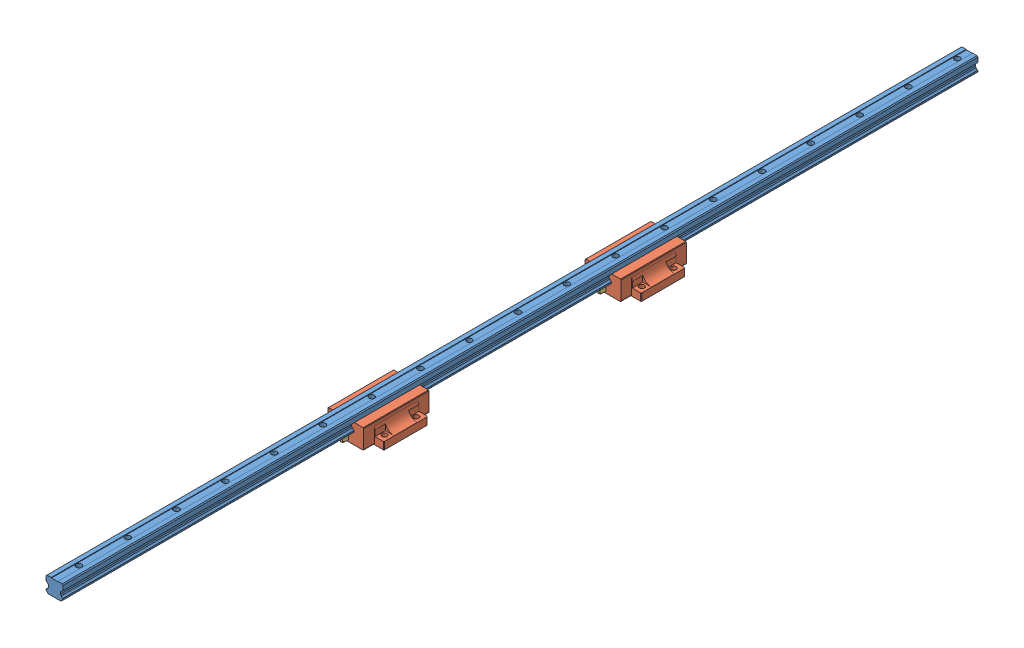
SolidWorks assembly Profilfuehrung.SLDASM, configuration Standard (file format 3800). Lengths in mm.
Overall size (90 41.55 1500).
5 component instances, 3 part files, 13 mates.
Components (placement in the parent):
- Schiene-1: Schiene.SLDPRT [Standard] at origin size (28 25.6 1500)
- Schlitten-1: Schlitten.SLDPRT [Standard] at (0 -14.4462 218.9869) size (90 32.55 107)
- Schlitten-2: Schlitten.SLDPRT [Standard] at (0 -14.4462 -202.8814) size (90 32.55 107)
- Schmiernippel_H2_M8-1: Schmiernippel_H2_M8.SLDPRT [F000245] at (0 -6.9462 272.4869) x (1 0 0) z (0 -1 0) size (15.01 21.01 9)
- Schmiernippel_H2_M8-2: Schmiernippel_H2_M8.SLDPRT [F000245] at (0 -6.9462 -149.3814) x (1 0 0) z (0 -1 0) size (15.01 21.01 9)
Mates (geometry in assembly coordinates):
- Deckungsgleich1: coincident anti-aligned: plane of Schiene-1 through (-10.5457 1.0038 -750) normal (0 -1 0); plane of Schlitten-1 through (-10.5458 1.0038 165.4869) normal (0 1 0)
- Deckungsgleich2: coincident aligned: unknown of Schiene-1
- Deckungsgleich3: coincident aligned: unknown of Schiene-1
- Deckungsgleich4: coincident aligned: unknown of Schiene-1
- Deckungsgleich6: coincident aligned: unknown of Schlitten-1
- Deckungsgleich7: coincident anti-aligned: plane of Schiene-1 through (-10.5457 1.0038 -750) normal (0 -1 0); plane of Schlitten-2 through (-10.5458 1.0038 -256.3814) normal (0 1 0)
- Deckungsgleich8: coincident aligned: unknown of Schlitten-2
- Deckungsgleich9: coincident anti-aligned: plane of Schlitten-1 through (-27.9 -12.9462 272.4869) normal (0 0 1); plane of Schmiernippel_H2_M8-1 through (-4.5 -11.4462 272.4869) normal (0 0 -1)
- Deckungsgleich10: coincident aligned: unknown of Schmiernippel_H2_M8-1
- Abstand1: distance = 3 mm aligned: plane of Schmiernippel_H2_M8-1 through (-4.5 -11.4462 272.4869) normal (0 -1 0); plane of Schlitten-1 through (-27.9 -14.4462 165.4869) normal (0 -1 0)
- Deckungsgleich12: coincident aligned: plane of Schmiernippel_H2_M8-2 through (-4.5 -11.4462 -149.3814) normal (0 -1 0); plane of Schmiernippel_H2_M8-1 through (-4.5 -11.4462 272.4869) normal (0 -1 0)
- Deckungsgleich13: coincident anti-aligned: plane of Schlitten-2 through (-27.9 -12.9462 -149.3814) normal (0 0 1); plane of Schmiernippel_H2_M8-2 through (-4.5 -11.4462 -149.3814) normal (0 0 -1)
- Deckungsgleich14: coincident aligned: unknown of Schmiernippel_H2_M8-2
